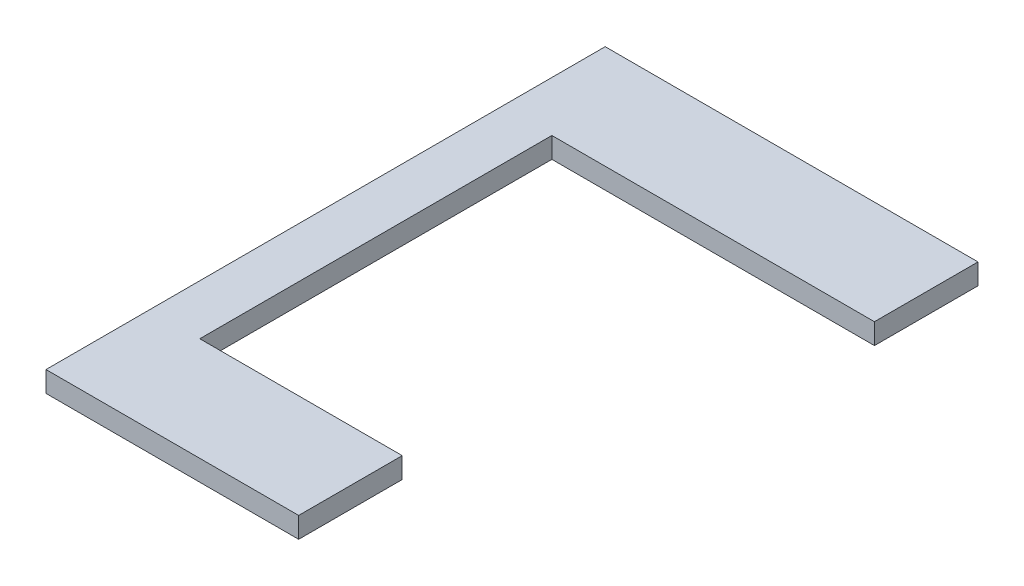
from build123d import *

# Parameters (mm, degrees)
Y_KSEKLIK_EKSTR_ZYON1_DEPTH = 50
IZIM2_W                     = 250
IZIM2_H                     = 50
Y_KSEKLIK_EKSTR_ZYON2_DEPTH = 10


with BuildPart() as part:
    # izim1 → Y_kseklik-Ekstr_zyon1 (new body)
    with BuildSketch(Plane(origin=(0, 0, 0), x_dir=(1, 0, 0), z_dir=(0, 1, 0))):
        Polygon((0, 0), (0, 1350), (900, 1350), (900, 1100), (121.292781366, 1100), (121.292781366, 250), (600, 250), (600, 0), align=None)
    extrude(amount=Y_KSEKLIK_EKSTR_ZYON1_DEPTH)

    # izim2 → Y_kseklik-Ekstr_zyon2 (add)
    with BuildSketch(Plane(origin=(600, 0, 0), x_dir=(0, 0, -1), z_dir=(1, 0, 0))):
        with Locations((125, 25)):
            Rectangle(IZIM2_W, IZIM2_H)
    extrude(amount=Y_KSEKLIK_EKSTR_ZYON2_DEPTH)


solid = part.part
